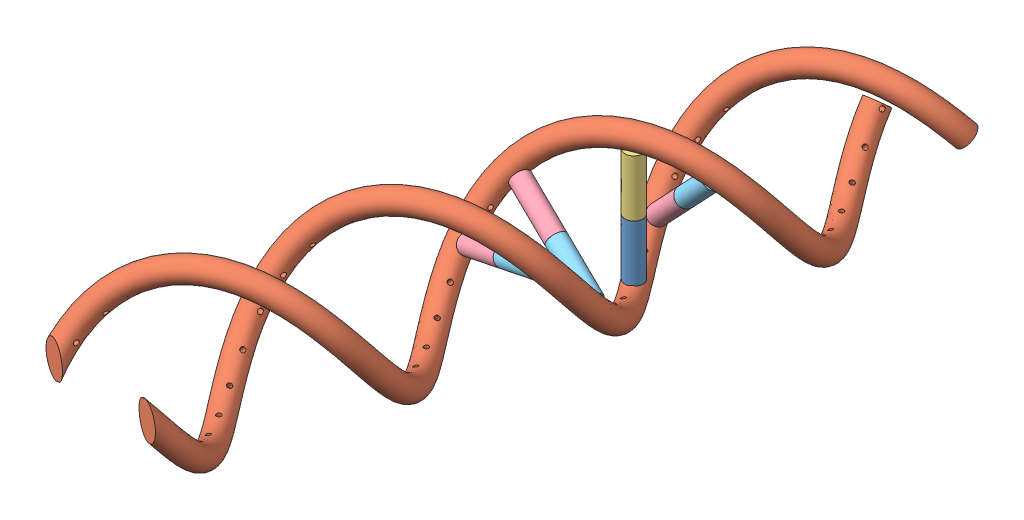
SolidWorks assembly Assembly of puzzle.SLDASM, configuration Default (file format 14000). Lengths in mm.
Overall size (361.67 207.36 648.49).
9 component instances, 5 part files, 16 mates.
Components (placement in the parent):
- A nucleotide-1: A nucleotide.SLDPRT [Default] at (29.4534 12.5357 41.4994) size (16 70 16)
- DNA backbone-1: DNA backbone.SLDPRT [Default] at (-73.5128 72.5419 420.0315) x (0.341784 -0.935167 0.092985) z (0.902381 0.354207 0.245452) size (160.82 615.65 160.82)
- T nucleotide-1: T nucleotide.SLDPRT [Default] at (29.4516 132.5357 41.497) x (0.986942 -0.000013 -0.161076) z (-0.161076 -0.000029 -0.986942) size (16 60 16)
- C nucleotide-1: C nucleotide.SLDPRT [Default] at (-48.7122 49.9801 117.0323) x (-0.202845 0.824374 -0.528451) z (0.399175 -0.42318 -0.813375) size (16 68 16)
- G nucleotide-1: G nucleotide.SLDPRT [Default] at (80.0773 115.086 16.5499) x (-0.133393 0.368053 -0.920186) z (-0.720664 0.60135 0.344996) size (16 60 16)
- C nucleotide-2: C nucleotide.SLDPRT [Default] at (-38.6489 95.7389 81.0507) x (-0.427072 -0.892724 0.143714) z (-0.160529 0.231269 0.959555) size (16 68 16)
- C nucleotide-3: C nucleotide.SLDPRT [Default] at (-1.5599 29.9842 -5.6549) x (0.227277 -0.444186 0.866628) z (-0.696784 0.547525 0.463366) size (16 68 16)
- G nucleotide-2: G nucleotide.SLDPRT [Default] at (58.5861 95.0942 146.2179) x (0.431478 -0.578423 -0.692282) z (-0.119579 0.723949 -0.679411) size (16 60 16)
- G nucleotide-3: G nucleotide.SLDPRT [Default] at (68.1335 49.3315 110.0999) x (0.44453 0.854367 -0.269165) z (-0.102728 0.347128 0.932174) size (16 60 16)
Mates (geometry in assembly coordinates):
- Concentric2: concentric: sphere of C nucleotide-2; sphere of G nucleotide-3
- Concentric3: concentric anti-aligned: cylinder of C nucleotide-2 through (-38.6489 95.7389 81.0507) axis (-0.889854 0.386728 -0.242077) radius 2; cylinder of G nucleotide-3 through (68.1335 49.3315 110.0999) axis (0.889854 -0.386728 0.242077) radius 2
- Concentric11: concentric anti-aligned: cylinder of DNA backbone-1 through (-38.6489 95.7389 81.0507) axis (0.889854 -0.386728 0.242077) radius 2.1; cylinder of C nucleotide-2 through (-38.6489 95.7389 81.0507) axis (-0.889854 0.386728 -0.242077) radius 2
- Coincident6: coincident anti-aligned: plane of DNA backbone-1 through (-38.6489 95.7389 81.0507) normal (0.889854 -0.386728 0.242077); plane of C nucleotide-2 through (-38.6489 95.7389 81.0507) normal (-0.889854 0.386728 -0.242077)
- Concentric17: concentric anti-aligned: cylinder of DNA backbone-1 through (-1.5599 29.9842 -5.6549) axis (0.680321 0.709165 0.185062) radius 2.1; cylinder of C nucleotide-3 through (-1.5599 29.9842 -5.6549) axis (-0.680321 -0.709165 -0.185062) radius 2
- Concentric18: concentric anti-aligned: cylinder of DNA backbone-1 through (80.0773 115.086 16.5499) axis (-0.680331 -0.709165 -0.185027) radius 2.1; cylinder of G nucleotide-1 through (80.0773 115.086 16.5499) axis (0.680331 0.709165 0.185027) radius 2
- Coincident7: coincident anti-aligned: circle of DNA backbone-1; plane of G nucleotide-1 through (80.0773 115.086 16.5499) normal (0.680331 0.709165 0.185027)
- Coincident8: coincident anti-aligned: plane of DNA backbone-1 through (-1.5599 29.9842 -5.6549) normal (0.680321 0.709165 0.185062); plane of C nucleotide-3 through (-1.5599 29.9842 -5.6549) normal (-0.680321 -0.709165 -0.185062)
- Coincident9: coincident anti-aligned: plane of A nucleotide-1 through (29.4534 12.5357 41.4994) normal (0 -1 0); plane of DNA backbone-1 through (29.4534 12.5357 41.4994) normal (0 1 0)
- Concentric19: concentric aligned: cylinder of A nucleotide-1 through (29.4534 82.5357 41.4994) axis (0 1 0) radius 2; cylinder of DNA backbone-1 through (29.4534 12.5357 41.4994) axis (0 1 0) radius 2.1
- Concentric20: concentric aligned: cylinder of DNA backbone-1 through (29.4516 132.5357 41.497) axis (-0.000008 -1 0.000031) radius 2.1; cylinder of T nucleotide-1 through (29.4511 82.5357 41.4985) axis (-0.000008 -1 0.000031) radius 2
- Coincident10: coincident anti-aligned: circle of DNA backbone-1; plane of T nucleotide-1 through (29.4516 132.5357 41.497) normal (0.000008 1 -0.000031)
- Concentric21: concentric anti-aligned: cylinder of DNA backbone-1 through (58.5861 95.0942 146.2179) axis (-0.894163 -0.375933 -0.243201) radius 2.1; cylinder of G nucleotide-2 through (58.5861 95.0942 146.2179) axis (0.894163 0.375933 0.243201) radius 2
- Coincident11: coincident aligned: circle of DNA backbone-1; plane of G nucleotide-2 through (58.5861 95.0942 146.2179) normal (0.894163 0.375933 0.243201)
- Coincident12: coincident anti-aligned: plane of DNA backbone-1 through (-48.7122 49.9801 117.0323) normal (0.894155 0.375933 0.24323); plane of C nucleotide-1 through (-48.7122 49.9801 117.0323) normal (-0.894155 -0.375933 -0.24323)
- Concentric22: concentric anti-aligned: cylinder of DNA backbone-1 through (-48.7122 49.9801 117.0323) axis (0.894155 0.375933 0.24323) radius 2.1; cylinder of C nucleotide-1 through (-48.7122 49.9801 117.0323) axis (-0.894155 -0.375933 -0.24323) radius 2
